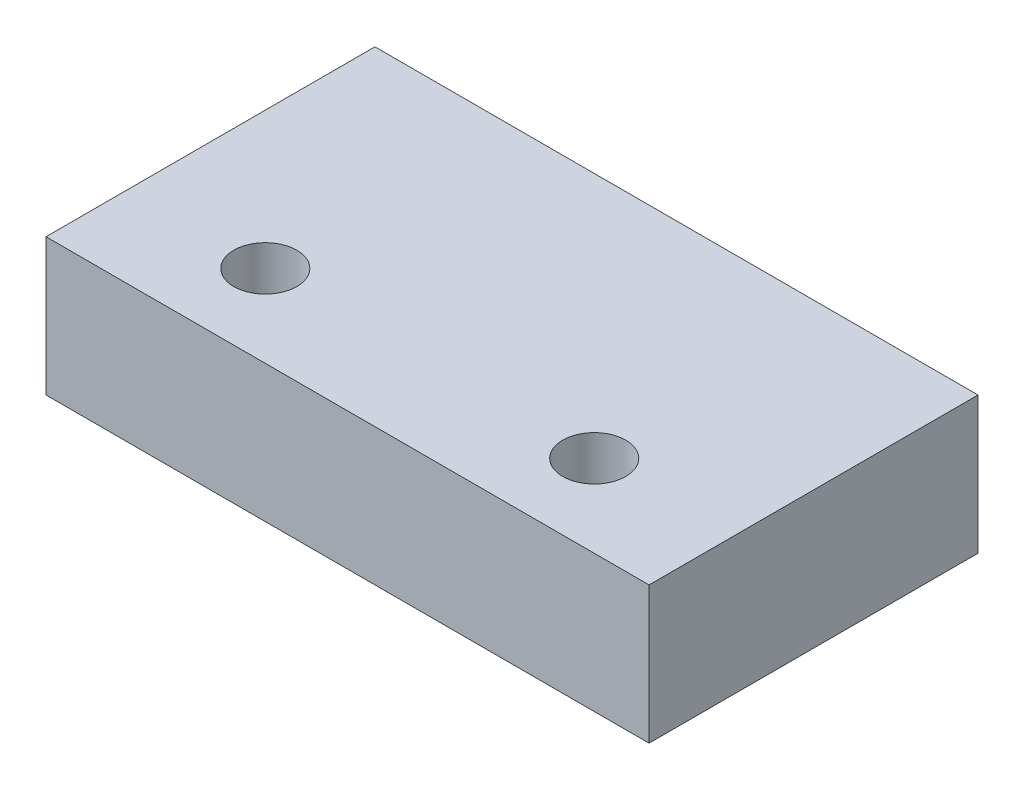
from build123d import *

# Parameters (mm, degrees)
SKIZZE1_W                       = 22
SKIZZE1_H                       = 12
SKIZZE1_R                       = 1.15
AUFSATZ_LINEAR_AUSTRAGEN1_DEPTH = 5


with BuildPart() as part:
    # Skizze1 → Aufsatz-Linear austragen1 (new body)
    with BuildSketch(Plane(origin=(0, 0, 0), x_dir=(1, 0, 0), z_dir=(0, 1, 0))):
        with Locations((0, -6)):
            Rectangle(SKIZZE1_W, SKIZZE1_H)
        with Locations(Location((-6, -9, 0), (0, 0, 270))):
            Circle(SKIZZE1_R, mode=Mode.SUBTRACT)
        with Locations(Location((6, -9, 0), (0, 0, 90))):
            Circle(SKIZZE1_R, mode=Mode.SUBTRACT)
    extrude(amount=AUFSATZ_LINEAR_AUSTRAGEN1_DEPTH)


solid = part.part
